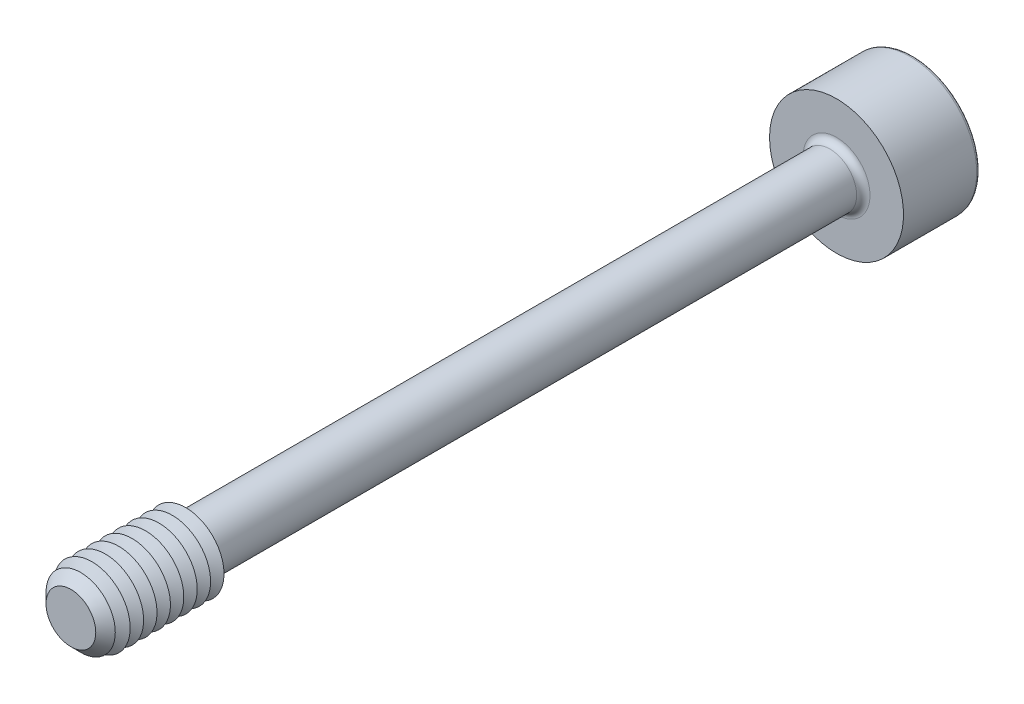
ISO-10303-21;
HEADER;
FILE_DESCRIPTION(('STEP AP214'),'2;1');
FILE_NAME('part.step','',(''),(''),'','','');
FILE_SCHEMA(('AUTOMOTIVE_DESIGN { 1 0 10303 214 1 1 1 1 }'));
ENDSEC;
DATA;
#1=APPLICATION_CONTEXT('core data for automotive mechanical design processes');
#2=APPLICATION_PROTOCOL_DEFINITION('international standard','automotive_design',2000,#1);
#3=PRODUCT_CONTEXT('',#1,'mechanical');
#4=PRODUCT('Part','Part','',(#3));
#5=PRODUCT_RELATED_PRODUCT_CATEGORY('part','',(#4));
#6=PRODUCT_DEFINITION_FORMATION('','',#4);
#7=PRODUCT_DEFINITION_CONTEXT('part definition',#1,'design');
#8=PRODUCT_DEFINITION('design','',#6,#7);
#9=PRODUCT_DEFINITION_SHAPE('','',#8);
#10=(LENGTH_UNIT() NAMED_UNIT(*) SI_UNIT(.MILLI.,.METRE.));
#11=(NAMED_UNIT(*) PLANE_ANGLE_UNIT() SI_UNIT($,.RADIAN.));
#12=(NAMED_UNIT(*) SI_UNIT($,.STERADIAN.) SOLID_ANGLE_UNIT());
#13=UNCERTAINTY_MEASURE_WITH_UNIT(LENGTH_MEASURE(1.E-05),#10,'distance_accuracy_value','');
#14=(GEOMETRIC_REPRESENTATION_CONTEXT(3) GLOBAL_UNCERTAINTY_ASSIGNED_CONTEXT((#13)) GLOBAL_UNIT_ASSIGNED_CONTEXT((#10,
#11,#12)) REPRESENTATION_CONTEXT('',''));
#15=CARTESIAN_POINT('',(0.,0.,0.));
#16=DIRECTION('',(0.,0.,1.));
#17=DIRECTION('',(1.,0.,0.));
#18=AXIS2_PLACEMENT_3D('',#15,#16,#17);
#19=CARTESIAN_POINT('',(-0.866025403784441,-1.5,-21.));
#20=DIRECTION('',(0.,0.,1.));
#21=DIRECTION('',(1.,0.,0.));
#22=AXIS2_PLACEMENT_3D('',#19,#20,#21);
#23=PLANE('',#22);
#24=DIRECTION('',(1.,0.,0.));
#25=VECTOR('',#24,1.);
#26=CARTESIAN_POINT('',(-0.866025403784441,-1.5,-21.));
#27=LINE('',#26,#25);
#28=CARTESIAN_POINT('',(0.,-1.5,-21.));
#29=VERTEX_POINT('',#28);
#30=CARTESIAN_POINT('',(0.866025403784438,-1.5,-21.));
#31=VERTEX_POINT('',#30);
#32=EDGE_CURVE('E762',#29,#31,#27,.T.);
#33=ORIENTED_EDGE('',*,*,#32,.F.);
#34=CARTESIAN_POINT('',(0.,0.,-21.));
#35=DIRECTION('',(0.,0.,1.));
#36=DIRECTION('',(0.,-1.,0.));
#37=AXIS2_PLACEMENT_3D('',#34,#35,#36);
#38=CIRCLE('',#37,1.5);
#39=CARTESIAN_POINT('',(1.29903810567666,-0.75,-21.));
#40=VERTEX_POINT('',#39);
#41=EDGE_CURVE('E53',#29,#40,#38,.T.);
#42=ORIENTED_EDGE('',*,*,#41,.T.);
#43=DIRECTION('',(0.5,0.866025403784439,0.));
#44=VECTOR('',#43,1.);
#45=CARTESIAN_POINT('',(0.866025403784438,-1.5,-21.));
#46=LINE('',#45,#44);
#47=EDGE_CURVE('E747',#31,#40,#46,.T.);
#48=ORIENTED_EDGE('',*,*,#47,.F.);
#49=EDGE_LOOP('',(#33,#42,#48));
#50=FACE_BOUND('',#49,.T.);
#51=ADVANCED_FACE('F41',(#50),#23,.F.);
#52=CARTESIAN_POINT('',(1.73205080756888,0.,-21.));
#53=VERTEX_POINT('',#52);
#54=EDGE_CURVE('E758',#40,#53,#46,.T.);
#55=ORIENTED_EDGE('',*,*,#54,.F.);
#56=CARTESIAN_POINT('',(1.29903810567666,0.749999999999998,-21.));
#57=VERTEX_POINT('',#56);
#58=EDGE_CURVE('E11',#40,#57,#38,.T.);
#59=ORIENTED_EDGE('',*,*,#58,.T.);
#60=DIRECTION('',(-0.5,0.866025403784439,0.));
#61=VECTOR('',#60,1.);
#62=CARTESIAN_POINT('',(1.73205080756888,0.,-21.));
#63=LINE('',#62,#61);
#64=EDGE_CURVE('E746',#53,#57,#63,.T.);
#65=ORIENTED_EDGE('',*,*,#64,.F.);
#66=EDGE_LOOP('',(#55,#59,#65));
#67=FACE_BOUND('',#66,.T.);
#68=ADVANCED_FACE('F133',(#67),#23,.F.);
#69=CARTESIAN_POINT('',(0.866025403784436,1.5,-21.));
#70=VERTEX_POINT('',#69);
#71=EDGE_CURVE('E741',#57,#70,#63,.T.);
#72=ORIENTED_EDGE('',*,*,#71,.F.);
#73=CARTESIAN_POINT('',(0.,1.5,-21.));
#74=VERTEX_POINT('',#73);
#75=EDGE_CURVE('E51',#57,#74,#38,.T.);
#76=ORIENTED_EDGE('',*,*,#75,.T.);
#77=DIRECTION('',(-1.,0.,0.));
#78=VECTOR('',#77,1.);
#79=CARTESIAN_POINT('',(0.866025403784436,1.5,-21.));
#80=LINE('',#79,#78);
#81=EDGE_CURVE('E177',#70,#74,#80,.T.);
#82=ORIENTED_EDGE('',*,*,#81,.F.);
#83=EDGE_LOOP('',(#72,#76,#82));
#84=FACE_BOUND('',#83,.T.);
#85=ADVANCED_FACE('F139',(#84),#23,.F.);
#86=CARTESIAN_POINT('',(-0.866025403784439,1.5,-21.));
#87=VERTEX_POINT('',#86);
#88=EDGE_CURVE('E751',#74,#87,#80,.T.);
#89=ORIENTED_EDGE('',*,*,#88,.F.);
#90=CARTESIAN_POINT('',(-1.29903810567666,0.749999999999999,-21.));
#91=VERTEX_POINT('',#90);
#92=EDGE_CURVE('E264',#74,#91,#38,.T.);
#93=ORIENTED_EDGE('',*,*,#92,.T.);
#94=DIRECTION('',(-0.5,-0.866025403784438,0.));
#95=VECTOR('',#94,1.);
#96=CARTESIAN_POINT('',(-0.866025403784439,1.5,-21.));
#97=LINE('',#96,#95);
#98=EDGE_CURVE('E176',#87,#91,#97,.T.);
#99=ORIENTED_EDGE('',*,*,#98,.F.);
#100=EDGE_LOOP('',(#89,#93,#99));
#101=FACE_BOUND('',#100,.T.);
#102=ADVANCED_FACE('F157',(#101),#23,.F.);
#103=CARTESIAN_POINT('',(-1.73205080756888,0.,-21.));
#104=VERTEX_POINT('',#103);
#105=EDGE_CURVE('E170',#91,#104,#97,.T.);
#106=ORIENTED_EDGE('',*,*,#105,.F.);
#107=CARTESIAN_POINT('',(-1.29903810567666,-0.749999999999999,-21.));
#108=VERTEX_POINT('',#107);
#109=EDGE_CURVE('E172',#91,#108,#38,.T.);
#110=ORIENTED_EDGE('',*,*,#109,.T.);
#111=DIRECTION('',(0.5,-0.866025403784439,0.));
#112=VECTOR('',#111,1.);
#113=CARTESIAN_POINT('',(-1.73205080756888,0.,-21.));
#114=LINE('',#113,#112);
#115=EDGE_CURVE('E174',#104,#108,#114,.T.);
#116=ORIENTED_EDGE('',*,*,#115,.F.);
#117=EDGE_LOOP('',(#106,#110,#116));
#118=FACE_BOUND('',#117,.T.);
#119=ADVANCED_FACE('F146',(#118),#23,.F.);
#120=CARTESIAN_POINT('',(0.,0.,-24.));
#121=DIRECTION('',(0.,0.,-1.));
#122=DIRECTION('',(-1.,0.,0.));
#123=AXIS2_PLACEMENT_3D('',#120,#121,#122);
#124=PLANE('',#123);
#125=CARTESIAN_POINT('',(0.,0.,-24.));
#126=DIRECTION('',(0.,0.,-1.));
#127=DIRECTION('',(-1.,0.,0.));
#128=AXIS2_PLACEMENT_3D('',#125,#126,#127);
#129=CIRCLE('',#128,3.325);
#130=CARTESIAN_POINT('',(-3.325,0.,-24.));
#131=VERTEX_POINT('',#130);
#132=EDGE_CURVE('E250',#131,#131,#129,.T.);
#133=ORIENTED_EDGE('',*,*,#132,.T.);
#134=EDGE_LOOP('',(#133));
#135=FACE_BOUND('',#134,.T.);
#136=DIRECTION('',(-0.5,-0.866025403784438,0.));
#137=VECTOR('',#136,1.);
#138=CARTESIAN_POINT('',(-0.866025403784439,1.5,-24.));
#139=LINE('',#138,#137);
#140=CARTESIAN_POINT('',(-0.866025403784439,1.5,-24.));
#141=VERTEX_POINT('',#140);
#142=CARTESIAN_POINT('',(-1.73205080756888,0.,-24.));
#143=VERTEX_POINT('',#142);
#144=EDGE_CURVE('E212',#141,#143,#139,.T.);
#145=ORIENTED_EDGE('',*,*,#144,.T.);
#146=DIRECTION('',(0.5,-0.866025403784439,0.));
#147=VECTOR('',#146,1.);
#148=CARTESIAN_POINT('',(-1.73205080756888,0.,-24.));
#149=LINE('',#148,#147);
#150=CARTESIAN_POINT('',(-0.866025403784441,-1.5,-24.));
#151=VERTEX_POINT('',#150);
#152=EDGE_CURVE('E67',#143,#151,#149,.T.);
#153=ORIENTED_EDGE('',*,*,#152,.T.);
#154=DIRECTION('',(1.,0.,0.));
#155=VECTOR('',#154,1.);
#156=CARTESIAN_POINT('',(-0.866025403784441,-1.5,-24.));
#157=LINE('',#156,#155);
#158=CARTESIAN_POINT('',(0.866025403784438,-1.5,-24.));
#159=VERTEX_POINT('',#158);
#160=EDGE_CURVE('E196',#151,#159,#157,.T.);
#161=ORIENTED_EDGE('',*,*,#160,.T.);
#162=DIRECTION('',(0.5,0.866025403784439,0.));
#163=VECTOR('',#162,1.);
#164=CARTESIAN_POINT('',(0.866025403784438,-1.5,-24.));
#165=LINE('',#164,#163);
#166=CARTESIAN_POINT('',(1.73205080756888,0.,-24.));
#167=VERTEX_POINT('',#166);
#168=EDGE_CURVE('E200',#159,#167,#165,.T.);
#169=ORIENTED_EDGE('',*,*,#168,.T.);
#170=DIRECTION('',(-0.5,0.866025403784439,0.));
#171=VECTOR('',#170,1.);
#172=CARTESIAN_POINT('',(1.73205080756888,0.,-24.));
#173=LINE('',#172,#171);
#174=CARTESIAN_POINT('',(0.866025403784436,1.5,-24.));
#175=VERTEX_POINT('',#174);
#176=EDGE_CURVE('E204',#167,#175,#173,.T.);
#177=ORIENTED_EDGE('',*,*,#176,.T.);
#178=DIRECTION('',(-1.,0.,0.));
#179=VECTOR('',#178,1.);
#180=CARTESIAN_POINT('',(0.866025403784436,1.5,-24.));
#181=LINE('',#180,#179);
#182=EDGE_CURVE('E208',#175,#141,#181,.T.);
#183=ORIENTED_EDGE('',*,*,#182,.T.);
#184=EDGE_LOOP('',(#145,#153,#161,#169,#177,#183));
#185=FACE_BOUND('',#184,.T.);
#186=ADVANCED_FACE('F156',(#135,#185),#124,.T.);
#187=CARTESIAN_POINT('',(0.,0.,20.));
#188=DIRECTION('',(0.,0.,-1.));
#189=DIRECTION('',(-1.,0.,0.));
#190=AXIS2_PLACEMENT_3D('',#187,#188,#189);
#191=CYLINDRICAL_SURFACE('',#190,1.4);
#192=CARTESIAN_POINT('',(0.,0.,-19.65));
#193=DIRECTION('',(0.,0.,-1.));
#194=DIRECTION('',(-1.,0.,0.));
#195=AXIS2_PLACEMENT_3D('',#192,#193,#194);
#196=CIRCLE('',#195,1.4);
#197=CARTESIAN_POINT('',(-1.4,0.,-19.65));
#198=VERTEX_POINT('',#197);
#199=EDGE_CURVE('E246',#198,#198,#196,.F.);
#200=ORIENTED_EDGE('',*,*,#199,.T.);
#201=EDGE_LOOP('',(#200));
#202=FACE_BOUND('',#201,.T.);
#203=CARTESIAN_POINT('',(0.,0.,13.6535898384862));
#204=DIRECTION('',(0.,0.,-1.));
#205=DIRECTION('',(0.,1.,0.));
#206=AXIS2_PLACEMENT_3D('',#203,#204,#205);
#207=CIRCLE('',#206,1.4);
#208=CARTESIAN_POINT('',(0.,1.4,13.6535898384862));
#209=VERTEX_POINT('',#208);
#210=EDGE_CURVE('E235',#209,#209,#207,.T.);
#211=ORIENTED_EDGE('',*,*,#210,.T.);
#212=EDGE_LOOP('',(#211));
#213=FACE_BOUND('',#212,.T.);
#214=ADVANCED_FACE('F163',(#202,#213),#191,.T.);
#215=CARTESIAN_POINT('',(0.,0.,13.6535898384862));
#216=DIRECTION('',(0.,0.,1.));
#217=DIRECTION('',(0.,-1.,0.));
#218=AXIS2_PLACEMENT_3D('',#215,#216,#217);
#219=CONICAL_SURFACE('',#218,1.4,1.0471975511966);
#220=CARTESIAN_POINT('',(0.,0.,14.));
#221=DIRECTION('',(0.,0.,-1.));
#222=DIRECTION('',(-1.,0.,0.));
#223=AXIS2_PLACEMENT_3D('',#220,#221,#222);
#224=CIRCLE('',#223,2.);
#225=CARTESIAN_POINT('',(-2.,0.,14.));
#226=VERTEX_POINT('',#225);
#227=EDGE_CURVE('E268',#226,#226,#224,.T.);
#228=ORIENTED_EDGE('',*,*,#227,.T.);
#229=EDGE_LOOP('',(#228));
#230=FACE_BOUND('',#229,.T.);
#231=ORIENTED_EDGE('',*,*,#210,.F.);
#232=EDGE_LOOP('',(#231));
#233=FACE_BOUND('',#232,.T.);
#234=ADVANCED_FACE('F510',(#230,#233),#219,.T.);
#235=CARTESIAN_POINT('',(0.,0.,-20.));
#236=DIRECTION('',(0.,0.,-1.));
#237=DIRECTION('',(-1.,0.,0.));
#238=AXIS2_PLACEMENT_3D('',#235,#236,#237);
#239=PLANE('',#238);
#240=CARTESIAN_POINT('',(0.,0.,-20.));
#241=DIRECTION('',(0.,0.,-1.));
#242=DIRECTION('',(-1.,0.,0.));
#243=AXIS2_PLACEMENT_3D('',#240,#241,#242);
#244=CIRCLE('',#243,1.75);
#245=CARTESIAN_POINT('',(-1.75,0.,-20.));
#246=VERTEX_POINT('',#245);
#247=EDGE_CURVE('E243',#246,#246,#244,.T.);
#248=ORIENTED_EDGE('',*,*,#247,.T.);
#249=EDGE_LOOP('',(#248));
#250=FACE_BOUND('',#249,.T.);
#251=CARTESIAN_POINT('',(0.,0.,-20.));
#252=DIRECTION('',(0.,0.,-1.));
#253=DIRECTION('',(-1.,0.,0.));
#254=AXIS2_PLACEMENT_3D('',#251,#252,#253);
#255=CIRCLE('',#254,3.5);
#256=CARTESIAN_POINT('',(-3.5,0.,-20.));
#257=VERTEX_POINT('',#256);
#258=EDGE_CURVE('E231',#257,#257,#255,.T.);
#259=ORIENTED_EDGE('',*,*,#258,.F.);
#260=EDGE_LOOP('',(#259));
#261=FACE_BOUND('',#260,.T.);
#262=ADVANCED_FACE('F503',(#250,#261),#239,.F.);
#263=CARTESIAN_POINT('',(0.,0.,-24.));
#264=DIRECTION('',(0.,0.,1.));
#265=DIRECTION('',(1.,0.,0.));
#266=AXIS2_PLACEMENT_3D('',#263,#264,#265);
#267=CYLINDRICAL_SURFACE('',#266,3.5);
#268=CARTESIAN_POINT('',(0.,0.,-23.825));
#269=DIRECTION('',(0.,0.,-1.));
#270=DIRECTION('',(-1.,0.,0.));
#271=AXIS2_PLACEMENT_3D('',#268,#269,#270);
#272=CIRCLE('',#271,3.5);
#273=CARTESIAN_POINT('',(-3.5,0.,-23.825));
#274=VERTEX_POINT('',#273);
#275=EDGE_CURVE('E253',#274,#274,#272,.F.);
#276=ORIENTED_EDGE('',*,*,#275,.T.);
#277=EDGE_LOOP('',(#276));
#278=FACE_BOUND('',#277,.T.);
#279=ORIENTED_EDGE('',*,*,#258,.T.);
#280=EDGE_LOOP('',(#279));
#281=FACE_BOUND('',#280,.T.);
#282=ADVANCED_FACE('F509',(#278,#281),#267,.T.);
#283=CARTESIAN_POINT('',(-1.73205080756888,0.,-21.));
#284=DIRECTION('',(0.866025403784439,0.5,0.));
#285=DIRECTION('',(-0.5,0.866025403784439,0.));
#286=AXIS2_PLACEMENT_3D('',#283,#284,#285);
#287=PLANE('',#286);
#288=ORIENTED_EDGE('',*,*,#152,.F.);
#289=DIRECTION('',(0.,0.,-1.));
#290=VECTOR('',#289,1.);
#291=CARTESIAN_POINT('',(-1.73205080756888,0.,-21.));
#292=LINE('',#291,#290);
#293=EDGE_CURVE('E186',#104,#143,#292,.T.);
#294=ORIENTED_EDGE('',*,*,#293,.F.);
#295=ORIENTED_EDGE('',*,*,#115,.T.);
#296=CARTESIAN_POINT('',(-0.866025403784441,-1.5,-21.));
#297=VERTEX_POINT('',#296);
#298=EDGE_CURVE('E215',#108,#297,#114,.T.);
#299=ORIENTED_EDGE('',*,*,#298,.T.);
#300=DIRECTION('',(0.,0.,-1.));
#301=VECTOR('',#300,1.);
#302=CARTESIAN_POINT('',(-0.866025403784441,-1.5,-21.));
#303=LINE('',#302,#301);
#304=EDGE_CURVE('E228',#297,#151,#303,.T.);
#305=ORIENTED_EDGE('',*,*,#304,.T.);
#306=EDGE_LOOP('',(#288,#294,#295,#299,#305));
#307=FACE_BOUND('',#306,.T.);
#308=ADVANCED_FACE('F521',(#307),#287,.T.);
#309=CARTESIAN_POINT('',(-0.866025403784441,-1.5,-21.));
#310=DIRECTION('',(0.,1.,0.));
#311=DIRECTION('',(0.,0.,1.));
#312=AXIS2_PLACEMENT_3D('',#309,#310,#311);
#313=PLANE('',#312);
#314=ORIENTED_EDGE('',*,*,#160,.F.);
#315=ORIENTED_EDGE('',*,*,#304,.F.);
#316=EDGE_CURVE('E759',#297,#29,#27,.T.);
#317=ORIENTED_EDGE('',*,*,#316,.T.);
#318=ORIENTED_EDGE('',*,*,#32,.T.);
#319=DIRECTION('',(0.,0.,-1.));
#320=VECTOR('',#319,1.);
#321=CARTESIAN_POINT('',(0.866025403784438,-1.5,-21.));
#322=LINE('',#321,#320);
#323=EDGE_CURVE('E225',#31,#159,#322,.T.);
#324=ORIENTED_EDGE('',*,*,#323,.T.);
#325=EDGE_LOOP('',(#314,#315,#317,#318,#324));
#326=FACE_BOUND('',#325,.T.);
#327=ADVANCED_FACE('F537',(#326),#313,.T.);
#328=CARTESIAN_POINT('',(0.866025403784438,-1.5,-21.));
#329=DIRECTION('',(-0.866025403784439,0.5,0.));
#330=DIRECTION('',(-0.5,-0.866025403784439,0.));
#331=AXIS2_PLACEMENT_3D('',#328,#329,#330);
#332=PLANE('',#331);
#333=ORIENTED_EDGE('',*,*,#168,.F.);
#334=ORIENTED_EDGE('',*,*,#323,.F.);
#335=ORIENTED_EDGE('',*,*,#47,.T.);
#336=ORIENTED_EDGE('',*,*,#54,.T.);
#337=DIRECTION('',(0.,0.,-1.));
#338=VECTOR('',#337,1.);
#339=CARTESIAN_POINT('',(1.73205080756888,0.,-21.));
#340=LINE('',#339,#338);
#341=EDGE_CURVE('E222',#53,#167,#340,.T.);
#342=ORIENTED_EDGE('',*,*,#341,.T.);
#343=EDGE_LOOP('',(#333,#334,#335,#336,#342));
#344=FACE_BOUND('',#343,.T.);
#345=ADVANCED_FACE('F547',(#344),#332,.T.);
#346=CARTESIAN_POINT('',(1.73205080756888,0.,-21.));
#347=DIRECTION('',(-0.866025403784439,-0.5,0.));
#348=DIRECTION('',(0.5,-0.866025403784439,0.));
#349=AXIS2_PLACEMENT_3D('',#346,#347,#348);
#350=PLANE('',#349);
#351=ORIENTED_EDGE('',*,*,#176,.F.);
#352=ORIENTED_EDGE('',*,*,#341,.F.);
#353=ORIENTED_EDGE('',*,*,#64,.T.);
#354=ORIENTED_EDGE('',*,*,#71,.T.);
#355=DIRECTION('',(0.,0.,-1.));
#356=VECTOR('',#355,1.);
#357=CARTESIAN_POINT('',(0.866025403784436,1.5,-21.));
#358=LINE('',#357,#356);
#359=EDGE_CURVE('E219',#70,#175,#358,.T.);
#360=ORIENTED_EDGE('',*,*,#359,.T.);
#361=EDGE_LOOP('',(#351,#352,#353,#354,#360));
#362=FACE_BOUND('',#361,.T.);
#363=ADVANCED_FACE('F557',(#362),#350,.T.);
#364=CARTESIAN_POINT('',(0.866025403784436,1.5,-21.));
#365=DIRECTION('',(0.,-1.,0.));
#366=DIRECTION('',(0.,0.,-1.));
#367=AXIS2_PLACEMENT_3D('',#364,#365,#366);
#368=PLANE('',#367);
#369=ORIENTED_EDGE('',*,*,#182,.F.);
#370=ORIENTED_EDGE('',*,*,#359,.F.);
#371=ORIENTED_EDGE('',*,*,#81,.T.);
#372=ORIENTED_EDGE('',*,*,#88,.T.);
#373=DIRECTION('',(0.,0.,-1.));
#374=VECTOR('',#373,1.);
#375=CARTESIAN_POINT('',(-0.866025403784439,1.5,-21.));
#376=LINE('',#375,#374);
#377=EDGE_CURVE('E182',#87,#141,#376,.T.);
#378=ORIENTED_EDGE('',*,*,#377,.T.);
#379=EDGE_LOOP('',(#369,#370,#371,#372,#378));
#380=FACE_BOUND('',#379,.T.);
#381=ADVANCED_FACE('F152',(#380),#368,.T.);
#382=CARTESIAN_POINT('',(-0.866025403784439,1.5,-21.));
#383=DIRECTION('',(0.866025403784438,-0.5,0.));
#384=DIRECTION('',(0.5,0.866025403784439,0.));
#385=AXIS2_PLACEMENT_3D('',#382,#383,#384);
#386=PLANE('',#385);
#387=ORIENTED_EDGE('',*,*,#144,.F.);
#388=ORIENTED_EDGE('',*,*,#377,.F.);
#389=ORIENTED_EDGE('',*,*,#98,.T.);
#390=ORIENTED_EDGE('',*,*,#105,.T.);
#391=ORIENTED_EDGE('',*,*,#293,.T.);
#392=EDGE_LOOP('',(#387,#388,#389,#390,#391));
#393=FACE_BOUND('',#392,.T.);
#394=ADVANCED_FACE('F144',(#393),#386,.T.);
#395=ORIENTED_EDGE('',*,*,#298,.F.);
#396=EDGE_CURVE('E256',#108,#29,#38,.T.);
#397=ORIENTED_EDGE('',*,*,#396,.T.);
#398=ORIENTED_EDGE('',*,*,#316,.F.);
#399=EDGE_LOOP('',(#395,#397,#398));
#400=FACE_BOUND('',#399,.T.);
#401=ADVANCED_FACE('F135',(#400),#23,.F.);
#402=CARTESIAN_POINT('',(0.,0.,-19.65));
#403=DIRECTION('',(0.,0.,-1.));
#404=DIRECTION('',(-1.,0.,0.));
#405=AXIS2_PLACEMENT_3D('',#402,#403,#404);
#406=TOROIDAL_SURFACE('',#405,1.75,0.35);
#407=ORIENTED_EDGE('',*,*,#199,.F.);
#408=EDGE_LOOP('',(#407));
#409=FACE_BOUND('',#408,.T.);
#410=ORIENTED_EDGE('',*,*,#247,.F.);
#411=EDGE_LOOP('',(#410));
#412=FACE_BOUND('',#411,.T.);
#413=ADVANCED_FACE('F129',(#409,#412),#406,.F.);
#414=CARTESIAN_POINT('',(0.,0.,-23.825));
#415=DIRECTION('',(0.,0.,-1.));
#416=DIRECTION('',(-1.,0.,0.));
#417=AXIS2_PLACEMENT_3D('',#414,#415,#416);
#418=TOROIDAL_SURFACE('',#417,3.325,0.175);
#419=ORIENTED_EDGE('',*,*,#275,.F.);
#420=EDGE_LOOP('',(#419));
#421=FACE_BOUND('',#420,.T.);
#422=ORIENTED_EDGE('',*,*,#132,.F.);
#423=EDGE_LOOP('',(#422));
#424=FACE_BOUND('',#423,.T.);
#425=ADVANCED_FACE('F43',(#421,#424),#418,.T.);
#426=CARTESIAN_POINT('',(0.,0.,-20.1339745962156));
#427=DIRECTION('',(0.,0.,-1.));
#428=DIRECTION('',(0.,1.,0.));
#429=AXIS2_PLACEMENT_3D('',#426,#427,#428);
#430=CONICAL_SURFACE('',#429,0.,1.04719755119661);
#431=ORIENTED_EDGE('',*,*,#41,.F.);
#432=ORIENTED_EDGE('',*,*,#396,.F.);
#433=ORIENTED_EDGE('',*,*,#109,.F.);
#434=ORIENTED_EDGE('',*,*,#92,.F.);
#435=ORIENTED_EDGE('',*,*,#75,.F.);
#436=ORIENTED_EDGE('',*,*,#58,.F.);
#437=EDGE_LOOP('',(#431,#432,#433,#434,#435,#436));
#438=FACE_BOUND('',#437,.T.);
#439=CARTESIAN_POINT('',(0.,0.,-20.1339745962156));
#440=VERTEX_POINT('',#439);
#441=VERTEX_LOOP('',#440);
#442=FACE_BOUND('',#441,.T.);
#443=ADVANCED_FACE('F118',(#438,#442),#430,.F.);
#444=CARTESIAN_POINT('',(0.,0.,14.35));
#445=DIRECTION('',(0.,0.,-1.));
#446=DIRECTION('',(-1.,0.,0.));
#447=AXIS2_PLACEMENT_3D('',#444,#445,#446);
#448=CONICAL_SURFACE('',#447,1.39378221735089,1.0471975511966);
#449=ORIENTED_EDGE('',*,*,#227,.F.);
#450=EDGE_LOOP('',(#449));
#451=FACE_BOUND('',#450,.T.);
#452=CARTESIAN_POINT('',(0.,0.,14.35));
#453=DIRECTION('',(0.,0.,-1.));
#454=DIRECTION('',(-1.,0.,0.));
#455=AXIS2_PLACEMENT_3D('',#452,#453,#454);
#456=CIRCLE('',#455,1.39378221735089);
#457=CARTESIAN_POINT('',(-1.39378221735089,0.,14.35));
#458=VERTEX_POINT('',#457);
#459=EDGE_CURVE('E273',#458,#458,#456,.T.);
#460=ORIENTED_EDGE('',*,*,#459,.T.);
#461=EDGE_LOOP('',(#460));
#462=FACE_BOUND('',#461,.T.);
#463=ADVANCED_FACE('F120',(#451,#462),#448,.T.);
#464=CARTESIAN_POINT('',(0.,0.,14.7));
#465=DIRECTION('',(0.,0.,1.));
#466=DIRECTION('',(1.,0.,0.));
#467=AXIS2_PLACEMENT_3D('',#464,#465,#466);
#468=CONICAL_SURFACE('',#467,2.,1.04719755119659);
#469=ORIENTED_EDGE('',*,*,#459,.F.);
#470=EDGE_LOOP('',(#469));
#471=FACE_BOUND('',#470,.T.);
#472=CARTESIAN_POINT('',(0.,0.,14.7));
#473=DIRECTION('',(0.,0.,-1.));
#474=DIRECTION('',(-1.,0.,0.));
#475=AXIS2_PLACEMENT_3D('',#472,#473,#474);
#476=CIRCLE('',#475,2.);
#477=CARTESIAN_POINT('',(-2.,0.,14.7));
#478=VERTEX_POINT('',#477);
#479=EDGE_CURVE('E280',#478,#478,#476,.T.);
#480=ORIENTED_EDGE('',*,*,#479,.T.);
#481=EDGE_LOOP('',(#480));
#482=FACE_BOUND('',#481,.T.);
#483=ADVANCED_FACE('F126',(#471,#482),#468,.T.);
#484=CARTESIAN_POINT('',(0.,0.,15.05));
#485=DIRECTION('',(0.,0.,-1.));
#486=DIRECTION('',(-1.,0.,0.));
#487=AXIS2_PLACEMENT_3D('',#484,#485,#486);
#488=CONICAL_SURFACE('',#487,1.39378221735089,1.0471975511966);
#489=ORIENTED_EDGE('',*,*,#479,.F.);
#490=EDGE_LOOP('',(#489));
#491=FACE_BOUND('',#490,.T.);
#492=CARTESIAN_POINT('',(0.,0.,15.05));
#493=DIRECTION('',(0.,0.,-1.));
#494=DIRECTION('',(-1.,0.,0.));
#495=AXIS2_PLACEMENT_3D('',#492,#493,#494);
#496=CIRCLE('',#495,1.39378221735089);
#497=CARTESIAN_POINT('',(-1.39378221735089,0.,15.05));
#498=VERTEX_POINT('',#497);
#499=EDGE_CURVE('E286',#498,#498,#496,.T.);
#500=ORIENTED_EDGE('',*,*,#499,.T.);
#501=EDGE_LOOP('',(#500));
#502=FACE_BOUND('',#501,.T.);
#503=ADVANCED_FACE('F397',(#491,#502),#488,.T.);
#504=CARTESIAN_POINT('',(0.,0.,15.4));
#505=DIRECTION('',(0.,0.,1.));
#506=DIRECTION('',(1.,0.,0.));
#507=AXIS2_PLACEMENT_3D('',#504,#505,#506);
#508=CONICAL_SURFACE('',#507,2.,1.04719755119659);
#509=ORIENTED_EDGE('',*,*,#499,.F.);
#510=EDGE_LOOP('',(#509));
#511=FACE_BOUND('',#510,.T.);
#512=CARTESIAN_POINT('',(0.,0.,15.4));
#513=DIRECTION('',(0.,0.,-1.));
#514=DIRECTION('',(-1.,0.,0.));
#515=AXIS2_PLACEMENT_3D('',#512,#513,#514);
#516=CIRCLE('',#515,2.);
#517=CARTESIAN_POINT('',(-2.,0.,15.4));
#518=VERTEX_POINT('',#517);
#519=EDGE_CURVE('E290',#518,#518,#516,.T.);
#520=ORIENTED_EDGE('',*,*,#519,.T.);
#521=EDGE_LOOP('',(#520));
#522=FACE_BOUND('',#521,.T.);
#523=ADVANCED_FACE('F393',(#511,#522),#508,.T.);
#524=CARTESIAN_POINT('',(0.,0.,15.75));
#525=DIRECTION('',(0.,0.,-1.));
#526=DIRECTION('',(-1.,0.,0.));
#527=AXIS2_PLACEMENT_3D('',#524,#525,#526);
#528=CONICAL_SURFACE('',#527,1.39378221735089,1.0471975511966);
#529=ORIENTED_EDGE('',*,*,#519,.F.);
#530=EDGE_LOOP('',(#529));
#531=FACE_BOUND('',#530,.T.);
#532=CARTESIAN_POINT('',(0.,0.,15.75));
#533=DIRECTION('',(0.,0.,-1.));
#534=DIRECTION('',(-1.,0.,0.));
#535=AXIS2_PLACEMENT_3D('',#532,#533,#534);
#536=CIRCLE('',#535,1.39378221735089);
#537=CARTESIAN_POINT('',(-1.39378221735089,0.,15.75));
#538=VERTEX_POINT('',#537);
#539=EDGE_CURVE('E294',#538,#538,#536,.T.);
#540=ORIENTED_EDGE('',*,*,#539,.T.);
#541=EDGE_LOOP('',(#540));
#542=FACE_BOUND('',#541,.T.);
#543=ADVANCED_FACE('F389',(#531,#542),#528,.T.);
#544=CARTESIAN_POINT('',(0.,0.,16.1));
#545=DIRECTION('',(0.,0.,1.));
#546=DIRECTION('',(1.,0.,0.));
#547=AXIS2_PLACEMENT_3D('',#544,#545,#546);
#548=CONICAL_SURFACE('',#547,2.,1.04719755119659);
#549=ORIENTED_EDGE('',*,*,#539,.F.);
#550=EDGE_LOOP('',(#549));
#551=FACE_BOUND('',#550,.T.);
#552=CARTESIAN_POINT('',(0.,0.,16.1));
#553=DIRECTION('',(0.,0.,-1.));
#554=DIRECTION('',(-1.,0.,0.));
#555=AXIS2_PLACEMENT_3D('',#552,#553,#554);
#556=CIRCLE('',#555,2.);
#557=CARTESIAN_POINT('',(-2.,0.,16.1));
#558=VERTEX_POINT('',#557);
#559=EDGE_CURVE('E298',#558,#558,#556,.T.);
#560=ORIENTED_EDGE('',*,*,#559,.T.);
#561=EDGE_LOOP('',(#560));
#562=FACE_BOUND('',#561,.T.);
#563=ADVANCED_FACE('F385',(#551,#562),#548,.T.);
#564=CARTESIAN_POINT('',(0.,0.,16.45));
#565=DIRECTION('',(0.,0.,-1.));
#566=DIRECTION('',(-1.,0.,0.));
#567=AXIS2_PLACEMENT_3D('',#564,#565,#566);
#568=CONICAL_SURFACE('',#567,1.39378221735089,1.0471975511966);
#569=ORIENTED_EDGE('',*,*,#559,.F.);
#570=EDGE_LOOP('',(#569));
#571=FACE_BOUND('',#570,.T.);
#572=CARTESIAN_POINT('',(0.,0.,16.45));
#573=DIRECTION('',(0.,0.,-1.));
#574=DIRECTION('',(-1.,0.,0.));
#575=AXIS2_PLACEMENT_3D('',#572,#573,#574);
#576=CIRCLE('',#575,1.39378221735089);
#577=CARTESIAN_POINT('',(-1.39378221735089,0.,16.45));
#578=VERTEX_POINT('',#577);
#579=EDGE_CURVE('E301',#578,#578,#576,.T.);
#580=ORIENTED_EDGE('',*,*,#579,.T.);
#581=EDGE_LOOP('',(#580));
#582=FACE_BOUND('',#581,.T.);
#583=ADVANCED_FACE('F381',(#571,#582),#568,.T.);
#584=CARTESIAN_POINT('',(0.,0.,16.8));
#585=DIRECTION('',(0.,0.,1.));
#586=DIRECTION('',(1.,0.,0.));
#587=AXIS2_PLACEMENT_3D('',#584,#585,#586);
#588=CONICAL_SURFACE('',#587,2.,1.04719755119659);
#589=ORIENTED_EDGE('',*,*,#579,.F.);
#590=EDGE_LOOP('',(#589));
#591=FACE_BOUND('',#590,.T.);
#592=CARTESIAN_POINT('',(0.,0.,16.8));
#593=DIRECTION('',(0.,0.,-1.));
#594=DIRECTION('',(-1.,0.,0.));
#595=AXIS2_PLACEMENT_3D('',#592,#593,#594);
#596=CIRCLE('',#595,2.);
#597=CARTESIAN_POINT('',(-2.,0.,16.8));
#598=VERTEX_POINT('',#597);
#599=EDGE_CURVE('E305',#598,#598,#596,.T.);
#600=ORIENTED_EDGE('',*,*,#599,.T.);
#601=EDGE_LOOP('',(#600));
#602=FACE_BOUND('',#601,.T.);
#603=ADVANCED_FACE('F377',(#591,#602),#588,.T.);
#604=CARTESIAN_POINT('',(0.,0.,17.15));
#605=DIRECTION('',(0.,0.,-1.));
#606=DIRECTION('',(-1.,0.,0.));
#607=AXIS2_PLACEMENT_3D('',#604,#605,#606);
#608=CONICAL_SURFACE('',#607,1.39378221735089,1.0471975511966);
#609=ORIENTED_EDGE('',*,*,#599,.F.);
#610=EDGE_LOOP('',(#609));
#611=FACE_BOUND('',#610,.T.);
#612=CARTESIAN_POINT('',(0.,0.,17.15));
#613=DIRECTION('',(0.,0.,-1.));
#614=DIRECTION('',(-1.,0.,0.));
#615=AXIS2_PLACEMENT_3D('',#612,#613,#614);
#616=CIRCLE('',#615,1.39378221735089);
#617=CARTESIAN_POINT('',(-1.39378221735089,0.,17.15));
#618=VERTEX_POINT('',#617);
#619=EDGE_CURVE('E309',#618,#618,#616,.T.);
#620=ORIENTED_EDGE('',*,*,#619,.T.);
#621=EDGE_LOOP('',(#620));
#622=FACE_BOUND('',#621,.T.);
#623=ADVANCED_FACE('F373',(#611,#622),#608,.T.);
#624=CARTESIAN_POINT('',(0.,0.,17.5));
#625=DIRECTION('',(0.,0.,1.));
#626=DIRECTION('',(1.,0.,0.));
#627=AXIS2_PLACEMENT_3D('',#624,#625,#626);
#628=CONICAL_SURFACE('',#627,2.,1.04719755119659);
#629=ORIENTED_EDGE('',*,*,#619,.F.);
#630=EDGE_LOOP('',(#629));
#631=FACE_BOUND('',#630,.T.);
#632=CARTESIAN_POINT('',(0.,0.,17.5));
#633=DIRECTION('',(0.,0.,-1.));
#634=DIRECTION('',(-1.,0.,0.));
#635=AXIS2_PLACEMENT_3D('',#632,#633,#634);
#636=CIRCLE('',#635,2.);
#637=CARTESIAN_POINT('',(-2.,0.,17.5));
#638=VERTEX_POINT('',#637);
#639=EDGE_CURVE('E313',#638,#638,#636,.T.);
#640=ORIENTED_EDGE('',*,*,#639,.T.);
#641=EDGE_LOOP('',(#640));
#642=FACE_BOUND('',#641,.T.);
#643=ADVANCED_FACE('F369',(#631,#642),#628,.T.);
#644=CARTESIAN_POINT('',(0.,0.,17.85));
#645=DIRECTION('',(0.,0.,-1.));
#646=DIRECTION('',(-1.,0.,0.));
#647=AXIS2_PLACEMENT_3D('',#644,#645,#646);
#648=CONICAL_SURFACE('',#647,1.39378221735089,1.0471975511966);
#649=ORIENTED_EDGE('',*,*,#639,.F.);
#650=EDGE_LOOP('',(#649));
#651=FACE_BOUND('',#650,.T.);
#652=CARTESIAN_POINT('',(0.,0.,17.85));
#653=DIRECTION('',(0.,0.,-1.));
#654=DIRECTION('',(-1.,0.,0.));
#655=AXIS2_PLACEMENT_3D('',#652,#653,#654);
#656=CIRCLE('',#655,1.39378221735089);
#657=CARTESIAN_POINT('',(-1.39378221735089,0.,17.85));
#658=VERTEX_POINT('',#657);
#659=EDGE_CURVE('E317',#658,#658,#656,.T.);
#660=ORIENTED_EDGE('',*,*,#659,.T.);
#661=EDGE_LOOP('',(#660));
#662=FACE_BOUND('',#661,.T.);
#663=ADVANCED_FACE('F365',(#651,#662),#648,.T.);
#664=CARTESIAN_POINT('',(0.,0.,18.2));
#665=DIRECTION('',(0.,0.,1.));
#666=DIRECTION('',(1.,0.,0.));
#667=AXIS2_PLACEMENT_3D('',#664,#665,#666);
#668=CONICAL_SURFACE('',#667,2.,1.04719755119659);
#669=ORIENTED_EDGE('',*,*,#659,.F.);
#670=EDGE_LOOP('',(#669));
#671=FACE_BOUND('',#670,.T.);
#672=CARTESIAN_POINT('',(0.,0.,18.2));
#673=DIRECTION('',(0.,0.,-1.));
#674=DIRECTION('',(-1.,0.,0.));
#675=AXIS2_PLACEMENT_3D('',#672,#673,#674);
#676=CIRCLE('',#675,2.);
#677=CARTESIAN_POINT('',(-2.,0.,18.2));
#678=VERTEX_POINT('',#677);
#679=EDGE_CURVE('E321',#678,#678,#676,.T.);
#680=ORIENTED_EDGE('',*,*,#679,.T.);
#681=EDGE_LOOP('',(#680));
#682=FACE_BOUND('',#681,.T.);
#683=ADVANCED_FACE('F361',(#671,#682),#668,.T.);
#684=CARTESIAN_POINT('',(0.,0.,18.55));
#685=DIRECTION('',(0.,0.,-1.));
#686=DIRECTION('',(-1.,0.,0.));
#687=AXIS2_PLACEMENT_3D('',#684,#685,#686);
#688=CONICAL_SURFACE('',#687,1.39378221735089,1.0471975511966);
#689=ORIENTED_EDGE('',*,*,#679,.F.);
#690=EDGE_LOOP('',(#689));
#691=FACE_BOUND('',#690,.T.);
#692=CARTESIAN_POINT('',(0.,0.,18.55));
#693=DIRECTION('',(0.,0.,-1.));
#694=DIRECTION('',(-1.,0.,0.));
#695=AXIS2_PLACEMENT_3D('',#692,#693,#694);
#696=CIRCLE('',#695,1.39378221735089);
#697=CARTESIAN_POINT('',(-1.39378221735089,0.,18.55));
#698=VERTEX_POINT('',#697);
#699=EDGE_CURVE('E325',#698,#698,#696,.T.);
#700=ORIENTED_EDGE('',*,*,#699,.T.);
#701=EDGE_LOOP('',(#700));
#702=FACE_BOUND('',#701,.T.);
#703=ADVANCED_FACE('F357',(#691,#702),#688,.T.);
#704=CARTESIAN_POINT('',(0.,0.,18.9));
#705=DIRECTION('',(0.,0.,1.));
#706=DIRECTION('',(1.,0.,0.));
#707=AXIS2_PLACEMENT_3D('',#704,#705,#706);
#708=CONICAL_SURFACE('',#707,2.,1.04719755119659);
#709=ORIENTED_EDGE('',*,*,#699,.F.);
#710=EDGE_LOOP('',(#709));
#711=FACE_BOUND('',#710,.T.);
#712=CARTESIAN_POINT('',(0.,0.,18.9));
#713=DIRECTION('',(0.,0.,-1.));
#714=DIRECTION('',(-1.,0.,0.));
#715=AXIS2_PLACEMENT_3D('',#712,#713,#714);
#716=CIRCLE('',#715,2.);
#717=CARTESIAN_POINT('',(-2.,0.,18.9));
#718=VERTEX_POINT('',#717);
#719=EDGE_CURVE('E329',#718,#718,#716,.T.);
#720=ORIENTED_EDGE('',*,*,#719,.T.);
#721=EDGE_LOOP('',(#720));
#722=FACE_BOUND('',#721,.T.);
#723=ADVANCED_FACE('F350',(#711,#722),#708,.T.);
#724=CARTESIAN_POINT('',(0.,0.,19.25));
#725=DIRECTION('',(0.,0.,-1.));
#726=DIRECTION('',(-1.,0.,0.));
#727=AXIS2_PLACEMENT_3D('',#724,#725,#726);
#728=CONICAL_SURFACE('',#727,1.39378221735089,1.0471975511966);
#729=ORIENTED_EDGE('',*,*,#719,.F.);
#730=EDGE_LOOP('',(#729));
#731=FACE_BOUND('',#730,.T.);
#732=CARTESIAN_POINT('',(0.,0.,19.25));
#733=DIRECTION('',(0.,0.,-1.));
#734=DIRECTION('',(-1.,0.,0.));
#735=AXIS2_PLACEMENT_3D('',#732,#733,#734);
#736=CIRCLE('',#735,1.39378221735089);
#737=CARTESIAN_POINT('',(-1.39378221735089,0.,19.25));
#738=VERTEX_POINT('',#737);
#739=EDGE_CURVE('E332',#738,#738,#736,.T.);
#740=ORIENTED_EDGE('',*,*,#739,.T.);
#741=EDGE_LOOP('',(#740));
#742=FACE_BOUND('',#741,.T.);
#743=ADVANCED_FACE('F336',(#731,#742),#728,.T.);
#744=CARTESIAN_POINT('',(0.,0.,19.6));
#745=DIRECTION('',(0.,0.,1.));
#746=DIRECTION('',(1.,0.,0.));
#747=AXIS2_PLACEMENT_3D('',#744,#745,#746);
#748=CONICAL_SURFACE('',#747,2.,1.04719755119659);
#749=CARTESIAN_POINT('',(0.,0.,19.4901923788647));
#750=DIRECTION('',(0.,0.,1.));
#751=DIRECTION('',(1.,0.,0.));
#752=AXIS2_PLACEMENT_3D('',#749,#750,#751);
#753=CIRCLE('',#752,1.80980762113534);
#754=CARTESIAN_POINT('',(1.80980762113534,0.,19.4901923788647));
#755=VERTEX_POINT('',#754);
#756=EDGE_CURVE('E45',#755,#755,#753,.F.);
#757=ORIENTED_EDGE('',*,*,#756,.T.);
#758=EDGE_LOOP('',(#757));
#759=FACE_BOUND('',#758,.T.);
#760=ORIENTED_EDGE('',*,*,#739,.F.);
#761=EDGE_LOOP('',(#760));
#762=FACE_BOUND('',#761,.T.);
#763=ADVANCED_FACE('F338',(#759,#762),#748,.T.);
#764=CARTESIAN_POINT('',(0.,0.,20.));
#765=DIRECTION('',(0.,0.,1.));
#766=DIRECTION('',(1.,0.,0.));
#767=AXIS2_PLACEMENT_3D('',#764,#765,#766);
#768=PLANE('',#767);
#769=CARTESIAN_POINT('',(0.,0.,20.));
#770=DIRECTION('',(0.,0.,1.));
#771=DIRECTION('',(1.,0.,0.));
#772=AXIS2_PLACEMENT_3D('',#769,#770,#771);
#773=CIRCLE('',#772,1.30000000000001);
#774=CARTESIAN_POINT('',(1.30000000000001,0.,20.));
#775=VERTEX_POINT('',#774);
#776=EDGE_CURVE('E239',#775,#775,#773,.T.);
#777=ORIENTED_EDGE('',*,*,#776,.T.);
#778=EDGE_LOOP('',(#777));
#779=FACE_BOUND('',#778,.T.);
#780=ADVANCED_FACE('F340',(#779),#768,.T.);
#781=CARTESIAN_POINT('',(0.,0.,19.3));
#782=DIRECTION('',(0.,0.,-1.));
#783=DIRECTION('',(0.,1.,0.));
#784=AXIS2_PLACEMENT_3D('',#781,#782,#783);
#785=CONICAL_SURFACE('',#784,2.,0.785398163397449);
#786=ORIENTED_EDGE('',*,*,#756,.F.);
#787=EDGE_LOOP('',(#786));
#788=FACE_BOUND('',#787,.T.);
#789=ORIENTED_EDGE('',*,*,#776,.F.);
#790=EDGE_LOOP('',(#789));
#791=FACE_BOUND('',#790,.T.);
#792=ADVANCED_FACE('F347',(#788,#791),#785,.T.);
#793=CLOSED_SHELL('',(#51,#68,#85,#102,#119,#186,#214,#234,#262,#282,#308,#327,#345,#363,#381,
#394,#401,#413,#425,#443,#463,#483,#503,#523,#543,#563,#583,#603,#623,#643,#663,#683,#703,#723,
#743,#763,#780,#792));
#794=MANIFOLD_SOLID_BREP('B2',#793);
#795=ADVANCED_BREP_SHAPE_REPRESENTATION('',(#18,#794),#14);
#796=SHAPE_DEFINITION_REPRESENTATION(#9,#795);
ENDSEC;
END-ISO-10303-21;
